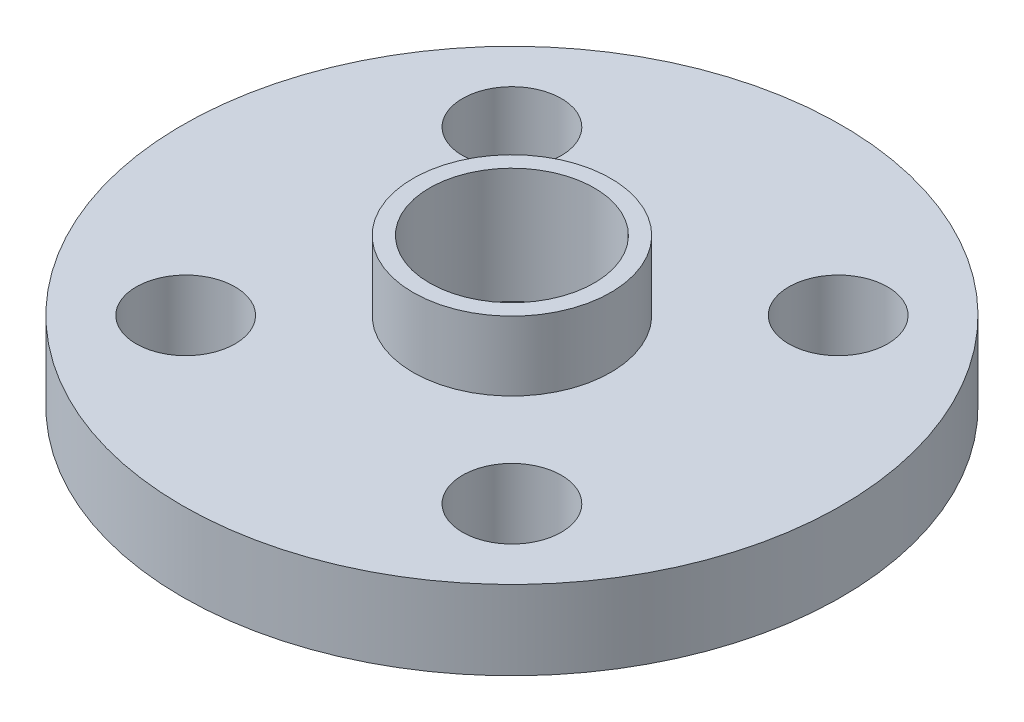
ISO-10303-21;
HEADER;
FILE_DESCRIPTION(('STEP AP214'),'2;1');
FILE_NAME('part.step','',(''),(''),'','','');
FILE_SCHEMA(('AUTOMOTIVE_DESIGN { 1 0 10303 214 1 1 1 1 }'));
ENDSEC;
DATA;
#1=APPLICATION_CONTEXT('core data for automotive mechanical design processes');
#2=APPLICATION_PROTOCOL_DEFINITION('international standard','automotive_design',2000,#1);
#3=PRODUCT_CONTEXT('',#1,'mechanical');
#4=PRODUCT('Part','Part','',(#3));
#5=PRODUCT_RELATED_PRODUCT_CATEGORY('part','',(#4));
#6=PRODUCT_DEFINITION_FORMATION('','',#4);
#7=PRODUCT_DEFINITION_CONTEXT('part definition',#1,'design');
#8=PRODUCT_DEFINITION('design','',#6,#7);
#9=PRODUCT_DEFINITION_SHAPE('','',#8);
#10=(LENGTH_UNIT() NAMED_UNIT(*) SI_UNIT(.MILLI.,.METRE.));
#11=(NAMED_UNIT(*) PLANE_ANGLE_UNIT() SI_UNIT($,.RADIAN.));
#12=(NAMED_UNIT(*) SI_UNIT($,.STERADIAN.) SOLID_ANGLE_UNIT());
#13=UNCERTAINTY_MEASURE_WITH_UNIT(LENGTH_MEASURE(1.E-05),#10,'distance_accuracy_value','');
#14=(GEOMETRIC_REPRESENTATION_CONTEXT(3) GLOBAL_UNCERTAINTY_ASSIGNED_CONTEXT((#13)) GLOBAL_UNIT_ASSIGNED_CONTEXT((#10,
#11,#12)) REPRESENTATION_CONTEXT('',''));
#15=CARTESIAN_POINT('',(0.,0.,0.));
#16=DIRECTION('',(0.,0.,1.));
#17=DIRECTION('',(1.,0.,0.));
#18=AXIS2_PLACEMENT_3D('',#15,#16,#17);
#19=CARTESIAN_POINT('',(0.,-0.0001,0.));
#20=DIRECTION('',(0.,1.,0.));
#21=DIRECTION('',(0.,0.,1.));
#22=AXIS2_PLACEMENT_3D('',#19,#20,#21);
#23=CYLINDRICAL_SURFACE('',#22,10.);
#24=CARTESIAN_POINT('',(0.,-0.0001,0.));
#25=DIRECTION('',(0.,1.,0.));
#26=DIRECTION('',(0.,0.,1.));
#27=AXIS2_PLACEMENT_3D('',#24,#25,#26);
#28=CIRCLE('',#27,10.);
#29=CARTESIAN_POINT('',(0.,-0.0001,10.));
#30=VERTEX_POINT('',#29);
#31=EDGE_CURVE('E12',#30,#30,#28,.T.);
#32=ORIENTED_EDGE('',*,*,#31,.T.);
#33=EDGE_LOOP('',(#32));
#34=FACE_BOUND('',#33,.T.);
#35=CARTESIAN_POINT('',(0.,2.4,0.));
#36=DIRECTION('',(0.,1.,0.));
#37=DIRECTION('',(0.,0.,1.));
#38=AXIS2_PLACEMENT_3D('',#35,#36,#37);
#39=CIRCLE('',#38,10.);
#40=CARTESIAN_POINT('',(0.,2.4,10.));
#41=VERTEX_POINT('',#40);
#42=EDGE_CURVE('E66',#41,#41,#39,.T.);
#43=ORIENTED_EDGE('',*,*,#42,.F.);
#44=EDGE_LOOP('',(#43));
#45=FACE_BOUND('',#44,.T.);
#46=ADVANCED_FACE('F44',(#34,#45),#23,.T.);
#47=CARTESIAN_POINT('',(0.,-0.0001,0.));
#48=DIRECTION('',(0.,1.,0.));
#49=DIRECTION('',(0.,0.,1.));
#50=AXIS2_PLACEMENT_3D('',#47,#48,#49);
#51=PLANE('',#50);
#52=CARTESIAN_POINT('',(0.,-0.000100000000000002,0.));
#53=DIRECTION('',(0.,1.,0.));
#54=DIRECTION('',(0.,0.,1.));
#55=AXIS2_PLACEMENT_3D('',#52,#53,#54);
#56=CIRCLE('',#55,1.5);
#57=CARTESIAN_POINT('',(0.,-0.000100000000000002,1.5));
#58=VERTEX_POINT('',#57);
#59=EDGE_CURVE('E47',#58,#58,#56,.T.);
#60=ORIENTED_EDGE('',*,*,#59,.T.);
#61=EDGE_LOOP('',(#60));
#62=FACE_BOUND('',#61,.T.);
#63=CARTESIAN_POINT('',(4.94974746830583,-0.0001,-4.94974746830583));
#64=DIRECTION('',(0.,1.,0.));
#65=DIRECTION('',(0.,0.,1.));
#66=AXIS2_PLACEMENT_3D('',#63,#64,#65);
#67=CIRCLE('',#66,1.5);
#68=CARTESIAN_POINT('',(4.94974746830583,-0.0001,-3.44974746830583));
#69=VERTEX_POINT('',#68);
#70=EDGE_CURVE('E63',#69,#69,#67,.T.);
#71=ORIENTED_EDGE('',*,*,#70,.T.);
#72=EDGE_LOOP('',(#71));
#73=FACE_BOUND('',#72,.T.);
#74=CARTESIAN_POINT('',(-4.94974746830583,-0.0001,-4.94974746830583));
#75=DIRECTION('',(0.,1.,0.));
#76=DIRECTION('',(0.,0.,1.));
#77=AXIS2_PLACEMENT_3D('',#74,#75,#76);
#78=CIRCLE('',#77,1.5);
#79=CARTESIAN_POINT('',(-4.94974746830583,-0.0001,-3.44974746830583));
#80=VERTEX_POINT('',#79);
#81=EDGE_CURVE('E60',#80,#80,#78,.T.);
#82=ORIENTED_EDGE('',*,*,#81,.T.);
#83=EDGE_LOOP('',(#82));
#84=FACE_BOUND('',#83,.T.);
#85=CARTESIAN_POINT('',(-4.94974746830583,-0.0001,4.94974746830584));
#86=DIRECTION('',(0.,1.,0.));
#87=DIRECTION('',(0.,0.,1.));
#88=AXIS2_PLACEMENT_3D('',#85,#86,#87);
#89=CIRCLE('',#88,1.5);
#90=CARTESIAN_POINT('',(-4.94974746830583,-0.0001,6.44974746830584));
#91=VERTEX_POINT('',#90);
#92=EDGE_CURVE('E55',#91,#91,#89,.T.);
#93=ORIENTED_EDGE('',*,*,#92,.T.);
#94=EDGE_LOOP('',(#93));
#95=FACE_BOUND('',#94,.T.);
#96=CARTESIAN_POINT('',(4.94974746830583,-0.0001,4.94974746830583));
#97=DIRECTION('',(0.,1.,0.));
#98=DIRECTION('',(0.,0.,1.));
#99=AXIS2_PLACEMENT_3D('',#96,#97,#98);
#100=CIRCLE('',#99,1.5);
#101=CARTESIAN_POINT('',(4.94974746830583,-0.0001,6.44974746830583));
#102=VERTEX_POINT('',#101);
#103=EDGE_CURVE('E51',#102,#102,#100,.T.);
#104=ORIENTED_EDGE('',*,*,#103,.T.);
#105=EDGE_LOOP('',(#104));
#106=FACE_BOUND('',#105,.T.);
#107=ORIENTED_EDGE('',*,*,#31,.F.);
#108=EDGE_LOOP('',(#107));
#109=FACE_BOUND('',#108,.T.);
#110=ADVANCED_FACE('F100',(#62,#73,#84,#95,#106,#109),#51,.F.);
#111=CARTESIAN_POINT('',(4.94974746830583,-0.0001,4.94974746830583));
#112=DIRECTION('',(0.,1.,0.));
#113=DIRECTION('',(0.,0.,1.));
#114=AXIS2_PLACEMENT_3D('',#111,#112,#113);
#115=CYLINDRICAL_SURFACE('',#114,1.5);
#116=ORIENTED_EDGE('',*,*,#103,.F.);
#117=EDGE_LOOP('',(#116));
#118=FACE_BOUND('',#117,.T.);
#119=CARTESIAN_POINT('',(4.94974746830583,2.4,4.94974746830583));
#120=DIRECTION('',(0.,1.,0.));
#121=DIRECTION('',(0.,0.,1.));
#122=AXIS2_PLACEMENT_3D('',#119,#120,#121);
#123=CIRCLE('',#122,1.5);
#124=CARTESIAN_POINT('',(4.94974746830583,2.4,6.44974746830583));
#125=VERTEX_POINT('',#124);
#126=EDGE_CURVE('E69',#125,#125,#123,.T.);
#127=ORIENTED_EDGE('',*,*,#126,.T.);
#128=EDGE_LOOP('',(#127));
#129=FACE_BOUND('',#128,.T.);
#130=ADVANCED_FACE('F117',(#118,#129),#115,.F.);
#131=CARTESIAN_POINT('',(-4.94974746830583,-0.0001,4.94974746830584));
#132=DIRECTION('',(0.,1.,0.));
#133=DIRECTION('',(0.,0.,1.));
#134=AXIS2_PLACEMENT_3D('',#131,#132,#133);
#135=CYLINDRICAL_SURFACE('',#134,1.5);
#136=ORIENTED_EDGE('',*,*,#92,.F.);
#137=EDGE_LOOP('',(#136));
#138=FACE_BOUND('',#137,.T.);
#139=CARTESIAN_POINT('',(-4.94974746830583,2.4,4.94974746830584));
#140=DIRECTION('',(0.,1.,0.));
#141=DIRECTION('',(0.,0.,1.));
#142=AXIS2_PLACEMENT_3D('',#139,#140,#141);
#143=CIRCLE('',#142,1.5);
#144=CARTESIAN_POINT('',(-4.94974746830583,2.4,6.44974746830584));
#145=VERTEX_POINT('',#144);
#146=EDGE_CURVE('E72',#145,#145,#143,.T.);
#147=ORIENTED_EDGE('',*,*,#146,.T.);
#148=EDGE_LOOP('',(#147));
#149=FACE_BOUND('',#148,.T.);
#150=ADVANCED_FACE('F139',(#138,#149),#135,.F.);
#151=CARTESIAN_POINT('',(-4.94974746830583,-0.0001,-4.94974746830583));
#152=DIRECTION('',(0.,1.,0.));
#153=DIRECTION('',(0.,0.,1.));
#154=AXIS2_PLACEMENT_3D('',#151,#152,#153);
#155=CYLINDRICAL_SURFACE('',#154,1.5);
#156=ORIENTED_EDGE('',*,*,#81,.F.);
#157=EDGE_LOOP('',(#156));
#158=FACE_BOUND('',#157,.T.);
#159=CARTESIAN_POINT('',(-4.94974746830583,2.4,-4.94974746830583));
#160=DIRECTION('',(0.,1.,0.));
#161=DIRECTION('',(0.,0.,1.));
#162=AXIS2_PLACEMENT_3D('',#159,#160,#161);
#163=CIRCLE('',#162,1.5);
#164=CARTESIAN_POINT('',(-4.94974746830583,2.4,-3.44974746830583));
#165=VERTEX_POINT('',#164);
#166=EDGE_CURVE('E75',#165,#165,#163,.T.);
#167=ORIENTED_EDGE('',*,*,#166,.T.);
#168=EDGE_LOOP('',(#167));
#169=FACE_BOUND('',#168,.T.);
#170=ADVANCED_FACE('F133',(#158,#169),#155,.F.);
#171=CARTESIAN_POINT('',(4.94974746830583,-0.0001,-4.94974746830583));
#172=DIRECTION('',(0.,1.,0.));
#173=DIRECTION('',(0.,0.,1.));
#174=AXIS2_PLACEMENT_3D('',#171,#172,#173);
#175=CYLINDRICAL_SURFACE('',#174,1.5);
#176=ORIENTED_EDGE('',*,*,#70,.F.);
#177=EDGE_LOOP('',(#176));
#178=FACE_BOUND('',#177,.T.);
#179=CARTESIAN_POINT('',(4.94974746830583,2.4,-4.94974746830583));
#180=DIRECTION('',(0.,1.,0.));
#181=DIRECTION('',(0.,0.,1.));
#182=AXIS2_PLACEMENT_3D('',#179,#180,#181);
#183=CIRCLE('',#182,1.5);
#184=CARTESIAN_POINT('',(4.94974746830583,2.4,-3.44974746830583));
#185=VERTEX_POINT('',#184);
#186=EDGE_CURVE('E78',#185,#185,#183,.T.);
#187=ORIENTED_EDGE('',*,*,#186,.T.);
#188=EDGE_LOOP('',(#187));
#189=FACE_BOUND('',#188,.T.);
#190=ADVANCED_FACE('F125',(#178,#189),#175,.F.);
#191=CARTESIAN_POINT('',(0.,2.4,0.));
#192=DIRECTION('',(0.,1.,0.));
#193=DIRECTION('',(0.,0.,1.));
#194=AXIS2_PLACEMENT_3D('',#191,#192,#193);
#195=PLANE('',#194);
#196=CARTESIAN_POINT('',(0.,2.4,0.));
#197=DIRECTION('',(0.,1.,0.));
#198=DIRECTION('',(0.,0.,1.));
#199=AXIS2_PLACEMENT_3D('',#196,#197,#198);
#200=CIRCLE('',#199,3.);
#201=CARTESIAN_POINT('',(0.,2.4,3.));
#202=VERTEX_POINT('',#201);
#203=EDGE_CURVE('E82',#202,#202,#200,.T.);
#204=ORIENTED_EDGE('',*,*,#203,.F.);
#205=EDGE_LOOP('',(#204));
#206=FACE_BOUND('',#205,.T.);
#207=ORIENTED_EDGE('',*,*,#166,.F.);
#208=EDGE_LOOP('',(#207));
#209=FACE_BOUND('',#208,.T.);
#210=ORIENTED_EDGE('',*,*,#126,.F.);
#211=EDGE_LOOP('',(#210));
#212=FACE_BOUND('',#211,.T.);
#213=ORIENTED_EDGE('',*,*,#42,.T.);
#214=EDGE_LOOP('',(#213));
#215=FACE_BOUND('',#214,.T.);
#216=ORIENTED_EDGE('',*,*,#146,.F.);
#217=EDGE_LOOP('',(#216));
#218=FACE_BOUND('',#217,.T.);
#219=ORIENTED_EDGE('',*,*,#186,.F.);
#220=EDGE_LOOP('',(#219));
#221=FACE_BOUND('',#220,.T.);
#222=ADVANCED_FACE('F121',(#206,#209,#212,#215,#218,#221),#195,.T.);
#223=CARTESIAN_POINT('',(0.,4.5,0.));
#224=DIRECTION('',(0.,1.,0.));
#225=DIRECTION('',(0.,0.,1.));
#226=AXIS2_PLACEMENT_3D('',#223,#224,#225);
#227=PLANE('',#226);
#228=CARTESIAN_POINT('',(0.,4.5,0.));
#229=DIRECTION('',(0.,1.,0.));
#230=DIRECTION('',(0.,0.,1.));
#231=AXIS2_PLACEMENT_3D('',#228,#229,#230);
#232=CIRCLE('',#231,3.);
#233=CARTESIAN_POINT('',(0.,4.5,3.));
#234=VERTEX_POINT('',#233);
#235=EDGE_CURVE('E81',#234,#234,#232,.T.);
#236=ORIENTED_EDGE('',*,*,#235,.T.);
#237=EDGE_LOOP('',(#236));
#238=FACE_BOUND('',#237,.T.);
#239=CARTESIAN_POINT('',(0.,4.5,0.));
#240=DIRECTION('',(0.,1.,0.));
#241=DIRECTION('',(0.,0.,1.));
#242=AXIS2_PLACEMENT_3D('',#239,#240,#241);
#243=CIRCLE('',#242,2.5);
#244=CARTESIAN_POINT('',(0.,4.5,2.5));
#245=VERTEX_POINT('',#244);
#246=EDGE_CURVE('E85',#245,#245,#243,.T.);
#247=ORIENTED_EDGE('',*,*,#246,.F.);
#248=EDGE_LOOP('',(#247));
#249=FACE_BOUND('',#248,.T.);
#250=ADVANCED_FACE('F124',(#238,#249),#227,.T.);
#251=CARTESIAN_POINT('',(0.,4.5,0.));
#252=DIRECTION('',(0.,-1.,0.));
#253=DIRECTION('',(0.,0.,-1.));
#254=AXIS2_PLACEMENT_3D('',#251,#252,#253);
#255=CYLINDRICAL_SURFACE('',#254,3.);
#256=ORIENTED_EDGE('',*,*,#235,.F.);
#257=EDGE_LOOP('',(#256));
#258=FACE_BOUND('',#257,.T.);
#259=ORIENTED_EDGE('',*,*,#203,.T.);
#260=EDGE_LOOP('',(#259));
#261=FACE_BOUND('',#260,.T.);
#262=ADVANCED_FACE('F187',(#258,#261),#255,.T.);
#263=CARTESIAN_POINT('',(0.,4.5,0.));
#264=DIRECTION('',(0.,-1.,0.));
#265=DIRECTION('',(0.,0.,-1.));
#266=AXIS2_PLACEMENT_3D('',#263,#264,#265);
#267=CYLINDRICAL_SURFACE('',#266,2.5);
#268=ORIENTED_EDGE('',*,*,#246,.T.);
#269=EDGE_LOOP('',(#268));
#270=FACE_BOUND('',#269,.T.);
#271=CARTESIAN_POINT('',(0.,1.,0.));
#272=DIRECTION('',(0.,1.,0.));
#273=DIRECTION('',(0.,0.,1.));
#274=AXIS2_PLACEMENT_3D('',#271,#272,#273);
#275=CIRCLE('',#274,2.5);
#276=CARTESIAN_POINT('',(0.,1.,2.5));
#277=VERTEX_POINT('',#276);
#278=EDGE_CURVE('E90',#277,#277,#275,.T.);
#279=ORIENTED_EDGE('',*,*,#278,.F.);
#280=EDGE_LOOP('',(#279));
#281=FACE_BOUND('',#280,.T.);
#282=ADVANCED_FACE('F110',(#270,#281),#267,.F.);
#283=CARTESIAN_POINT('',(0.,1.,0.));
#284=DIRECTION('',(0.,1.,0.));
#285=DIRECTION('',(0.,0.,1.));
#286=AXIS2_PLACEMENT_3D('',#283,#284,#285);
#287=PLANE('',#286);
#288=CARTESIAN_POINT('',(0.,1.,0.));
#289=DIRECTION('',(0.,1.,0.));
#290=DIRECTION('',(0.,0.,1.));
#291=AXIS2_PLACEMENT_3D('',#288,#289,#290);
#292=CIRCLE('',#291,1.5);
#293=CARTESIAN_POINT('',(0.,1.,1.5));
#294=VERTEX_POINT('',#293);
#295=EDGE_CURVE('E93',#294,#294,#292,.T.);
#296=ORIENTED_EDGE('',*,*,#295,.F.);
#297=EDGE_LOOP('',(#296));
#298=FACE_BOUND('',#297,.T.);
#299=ORIENTED_EDGE('',*,*,#278,.T.);
#300=EDGE_LOOP('',(#299));
#301=FACE_BOUND('',#300,.T.);
#302=ADVANCED_FACE('F105',(#298,#301),#287,.T.);
#303=CARTESIAN_POINT('',(0.,-0.4,0.));
#304=DIRECTION('',(0.,1.,0.));
#305=DIRECTION('',(0.,0.,1.));
#306=AXIS2_PLACEMENT_3D('',#303,#304,#305);
#307=CYLINDRICAL_SURFACE('',#306,1.5);
#308=ORIENTED_EDGE('',*,*,#295,.T.);
#309=EDGE_LOOP('',(#308));
#310=FACE_BOUND('',#309,.T.);
#311=ORIENTED_EDGE('',*,*,#59,.F.);
#312=EDGE_LOOP('',(#311));
#313=FACE_BOUND('',#312,.T.);
#314=ADVANCED_FACE('F103',(#310,#313),#307,.F.);
#315=CLOSED_SHELL('',(#46,#110,#130,#150,#170,#190,#222,#250,#262,#282,#302,#314));
#316=MANIFOLD_SOLID_BREP('B2',#315);
#317=ADVANCED_BREP_SHAPE_REPRESENTATION('',(#18,#316),#14);
#318=SHAPE_DEFINITION_REPRESENTATION(#9,#317);
ENDSEC;
END-ISO-10303-21;
